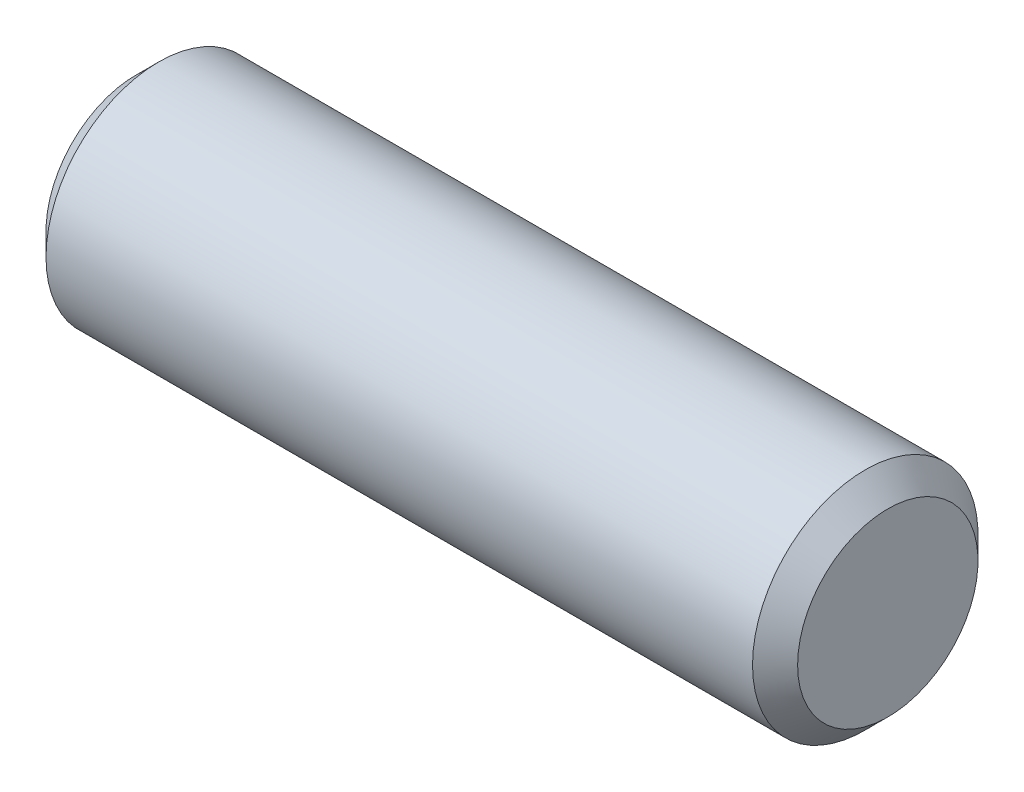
ISO-10303-21;
HEADER;
FILE_DESCRIPTION(('STEP AP214'),'2;1');
FILE_NAME('part.step','',(''),(''),'','','');
FILE_SCHEMA(('AUTOMOTIVE_DESIGN { 1 0 10303 214 1 1 1 1 }'));
ENDSEC;
DATA;
#1=APPLICATION_CONTEXT('core data for automotive mechanical design processes');
#2=APPLICATION_PROTOCOL_DEFINITION('international standard','automotive_design',2000,#1);
#3=PRODUCT_CONTEXT('',#1,'mechanical');
#4=PRODUCT('Part','Part','',(#3));
#5=PRODUCT_RELATED_PRODUCT_CATEGORY('part','',(#4));
#6=PRODUCT_DEFINITION_FORMATION('','',#4);
#7=PRODUCT_DEFINITION_CONTEXT('part definition',#1,'design');
#8=PRODUCT_DEFINITION('design','',#6,#7);
#9=PRODUCT_DEFINITION_SHAPE('','',#8);
#10=(LENGTH_UNIT() NAMED_UNIT(*) SI_UNIT(.MILLI.,.METRE.));
#11=(NAMED_UNIT(*) PLANE_ANGLE_UNIT() SI_UNIT($,.RADIAN.));
#12=(NAMED_UNIT(*) SI_UNIT($,.STERADIAN.) SOLID_ANGLE_UNIT());
#13=UNCERTAINTY_MEASURE_WITH_UNIT(LENGTH_MEASURE(1.E-05),#10,'distance_accuracy_value','');
#14=(GEOMETRIC_REPRESENTATION_CONTEXT(3) GLOBAL_UNCERTAINTY_ASSIGNED_CONTEXT((#13)) GLOBAL_UNIT_ASSIGNED_CONTEXT((#10,
#11,#12)) REPRESENTATION_CONTEXT('',''));
#15=CARTESIAN_POINT('',(0.,0.,0.));
#16=DIRECTION('',(0.,0.,1.));
#17=DIRECTION('',(1.,0.,0.));
#18=AXIS2_PLACEMENT_3D('',#15,#16,#17);
#19=CARTESIAN_POINT('',(0.,0.,0.));
#20=DIRECTION('',(1.,0.,0.));
#21=DIRECTION('',(0.,0.,-1.));
#22=AXIS2_PLACEMENT_3D('',#19,#20,#21);
#23=PLANE('',#22);
#24=CARTESIAN_POINT('',(0.,0.,0.));
#25=DIRECTION('',(1.,0.,0.));
#26=DIRECTION('',(0.,0.,-1.));
#27=AXIS2_PLACEMENT_3D('',#24,#25,#26);
#28=CIRCLE('',#27,1.2);
#29=CARTESIAN_POINT('',(0.,0.,-1.2));
#30=VERTEX_POINT('',#29);
#31=EDGE_CURVE('E127',#30,#30,#28,.F.);
#32=ORIENTED_EDGE('',*,*,#31,.T.);
#33=EDGE_LOOP('',(#32));
#34=FACE_BOUND('',#33,.T.);
#35=DIRECTION('',(0.,0.866025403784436,-0.500000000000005));
#36=VECTOR('',#35,1.);
#37=CARTESIAN_POINT('',(0.,0.,0.866025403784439));
#38=LINE('',#37,#36);
#39=CARTESIAN_POINT('',(0.,0.,0.866025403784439));
#40=VERTEX_POINT('',#39);
#41=CARTESIAN_POINT('',(0.,0.750000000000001,0.433012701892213));
#42=VERTEX_POINT('',#41);
#43=EDGE_CURVE('E95',#40,#42,#38,.T.);
#44=ORIENTED_EDGE('',*,*,#43,.F.);
#45=DIRECTION('',(0.,0.866025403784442,0.499999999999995));
#46=VECTOR('',#45,1.);
#47=CARTESIAN_POINT('',(0.,-0.749999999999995,0.433012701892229));
#48=LINE('',#47,#46);
#49=CARTESIAN_POINT('',(0.,-0.749999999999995,0.433012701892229));
#50=VERTEX_POINT('',#49);
#51=EDGE_CURVE('E41',#50,#40,#48,.T.);
#52=ORIENTED_EDGE('',*,*,#51,.F.);
#53=DIRECTION('',(0.,0.,1.));
#54=VECTOR('',#53,1.);
#55=CARTESIAN_POINT('',(0.,-0.75,-0.433012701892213));
#56=LINE('',#55,#54);
#57=CARTESIAN_POINT('',(0.,-0.75,-0.433012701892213));
#58=VERTEX_POINT('',#57);
#59=EDGE_CURVE('E109',#58,#50,#56,.T.);
#60=ORIENTED_EDGE('',*,*,#59,.F.);
#61=DIRECTION('',(0.,-0.866025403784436,0.500000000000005));
#62=VECTOR('',#61,1.);
#63=CARTESIAN_POINT('',(0.,0.,-0.866025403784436));
#64=LINE('',#63,#62);
#65=CARTESIAN_POINT('',(0.,0.,-0.866025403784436));
#66=VERTEX_POINT('',#65);
#67=EDGE_CURVE('E103',#66,#58,#64,.T.);
#68=ORIENTED_EDGE('',*,*,#67,.F.);
#69=DIRECTION('',(0.,-0.866025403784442,-0.499999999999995));
#70=VECTOR('',#69,1.);
#71=CARTESIAN_POINT('',(0.,0.749999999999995,-0.433012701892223));
#72=LINE('',#71,#70);
#73=CARTESIAN_POINT('',(0.,0.749999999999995,-0.433012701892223));
#74=VERTEX_POINT('',#73);
#75=EDGE_CURVE('E101',#74,#66,#72,.T.);
#76=ORIENTED_EDGE('',*,*,#75,.F.);
#77=DIRECTION('',(0.,0.,-1.));
#78=VECTOR('',#77,1.);
#79=CARTESIAN_POINT('',(0.,0.750000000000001,0.433012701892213));
#80=LINE('',#79,#78);
#81=EDGE_CURVE('E84',#42,#74,#80,.T.);
#82=ORIENTED_EDGE('',*,*,#81,.F.);
#83=EDGE_LOOP('',(#44,#52,#60,#68,#76,#82));
#84=FACE_BOUND('',#83,.T.);
#85=ADVANCED_FACE('F27',(#34,#84),#23,.F.);
#86=CARTESIAN_POINT('',(0.,0.,0.));
#87=DIRECTION('',(-1.,0.,0.));
#88=DIRECTION('',(0.,0.,1.));
#89=AXIS2_PLACEMENT_3D('',#86,#87,#88);
#90=CYLINDRICAL_SURFACE('',#89,1.5);
#91=CARTESIAN_POINT('',(0.300000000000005,0.,0.));
#92=DIRECTION('',(1.,0.,0.));
#93=DIRECTION('',(0.,0.,-1.));
#94=AXIS2_PLACEMENT_3D('',#91,#92,#93);
#95=CIRCLE('',#94,1.5);
#96=CARTESIAN_POINT('',(0.300000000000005,0.,-1.5));
#97=VERTEX_POINT('',#96);
#98=EDGE_CURVE('E34',#97,#97,#95,.T.);
#99=ORIENTED_EDGE('',*,*,#98,.T.);
#100=EDGE_LOOP('',(#99));
#101=FACE_BOUND('',#100,.T.);
#102=CARTESIAN_POINT('',(9.69999999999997,0.,0.));
#103=DIRECTION('',(-1.,0.,0.));
#104=DIRECTION('',(0.,0.,1.));
#105=AXIS2_PLACEMENT_3D('',#102,#103,#104);
#106=CIRCLE('',#105,1.5);
#107=CARTESIAN_POINT('',(9.69999999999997,0.,1.5));
#108=VERTEX_POINT('',#107);
#109=EDGE_CURVE('E136',#108,#108,#106,.T.);
#110=ORIENTED_EDGE('',*,*,#109,.T.);
#111=EDGE_LOOP('',(#110));
#112=FACE_BOUND('',#111,.T.);
#113=ADVANCED_FACE('F141',(#101,#112),#90,.T.);
#114=CARTESIAN_POINT('',(9.99999999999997,1.5,0.));
#115=DIRECTION('',(-1.,0.,0.));
#116=DIRECTION('',(0.,0.,1.));
#117=AXIS2_PLACEMENT_3D('',#114,#115,#116);
#118=PLANE('',#117);
#119=CARTESIAN_POINT('',(9.99999999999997,0.,0.));
#120=DIRECTION('',(-1.,0.,0.));
#121=DIRECTION('',(0.,0.,1.));
#122=AXIS2_PLACEMENT_3D('',#119,#120,#121);
#123=CIRCLE('',#122,1.2);
#124=CARTESIAN_POINT('',(9.99999999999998,0.,1.2));
#125=VERTEX_POINT('',#124);
#126=EDGE_CURVE('E11',#125,#125,#123,.F.);
#127=ORIENTED_EDGE('',*,*,#126,.T.);
#128=EDGE_LOOP('',(#127));
#129=FACE_BOUND('',#128,.T.);
#130=ADVANCED_FACE('F156',(#129),#118,.F.);
#131=CARTESIAN_POINT('',(1.5,-0.749999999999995,0.433012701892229));
#132=DIRECTION('',(0.,-0.499999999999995,0.866025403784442));
#133=DIRECTION('',(0.,-0.866025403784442,-0.499999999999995));
#134=AXIS2_PLACEMENT_3D('',#131,#132,#133);
#135=PLANE('',#134);
#136=ORIENTED_EDGE('',*,*,#51,.T.);
#137=DIRECTION('',(-1.,0.,0.));
#138=VECTOR('',#137,1.);
#139=CARTESIAN_POINT('',(1.5,0.,0.866025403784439));
#140=LINE('',#139,#138);
#141=CARTESIAN_POINT('',(1.5,0.,0.866025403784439));
#142=VERTEX_POINT('',#141);
#143=EDGE_CURVE('E92',#142,#40,#140,.T.);
#144=ORIENTED_EDGE('',*,*,#143,.F.);
#145=DIRECTION('',(0.,0.866025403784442,0.499999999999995));
#146=VECTOR('',#145,1.);
#147=CARTESIAN_POINT('',(1.5,-0.749999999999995,0.433012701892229));
#148=LINE('',#147,#146);
#149=CARTESIAN_POINT('',(1.5,-0.749999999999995,0.433012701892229));
#150=VERTEX_POINT('',#149);
#151=EDGE_CURVE('E111',#150,#142,#148,.T.);
#152=ORIENTED_EDGE('',*,*,#151,.F.);
#153=DIRECTION('',(-1.,0.,0.));
#154=VECTOR('',#153,1.);
#155=CARTESIAN_POINT('',(1.5,-0.749999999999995,0.433012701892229));
#156=LINE('',#155,#154);
#157=EDGE_CURVE('E48',#150,#50,#156,.T.);
#158=ORIENTED_EDGE('',*,*,#157,.T.);
#159=EDGE_LOOP('',(#136,#144,#152,#158));
#160=FACE_BOUND('',#159,.T.);
#161=ADVANCED_FACE('F160',(#160),#135,.F.);
#162=CARTESIAN_POINT('',(1.5,-0.75,-0.433012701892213));
#163=DIRECTION('',(0.,-1.,0.));
#164=DIRECTION('',(0.,0.,-1.));
#165=AXIS2_PLACEMENT_3D('',#162,#163,#164);
#166=PLANE('',#165);
#167=ORIENTED_EDGE('',*,*,#59,.T.);
#168=ORIENTED_EDGE('',*,*,#157,.F.);
#169=DIRECTION('',(0.,0.,1.));
#170=VECTOR('',#169,1.);
#171=CARTESIAN_POINT('',(1.5,-0.75,-0.433012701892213));
#172=LINE('',#171,#170);
#173=CARTESIAN_POINT('',(1.5,-0.75,-0.433012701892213));
#174=VERTEX_POINT('',#173);
#175=EDGE_CURVE('E123',#174,#150,#172,.T.);
#176=ORIENTED_EDGE('',*,*,#175,.F.);
#177=DIRECTION('',(-1.,0.,0.));
#178=VECTOR('',#177,1.);
#179=CARTESIAN_POINT('',(1.5,-0.75,-0.433012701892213));
#180=LINE('',#179,#178);
#181=EDGE_CURVE('E128',#174,#58,#180,.T.);
#182=ORIENTED_EDGE('',*,*,#181,.T.);
#183=EDGE_LOOP('',(#167,#168,#176,#182));
#184=FACE_BOUND('',#183,.T.);
#185=ADVANCED_FACE('F166',(#184),#166,.F.);
#186=CARTESIAN_POINT('',(1.5,0.,-0.866025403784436));
#187=DIRECTION('',(0.,-0.500000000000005,-0.866025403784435));
#188=DIRECTION('',(0.,0.866025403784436,-0.500000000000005));
#189=AXIS2_PLACEMENT_3D('',#186,#187,#188);
#190=PLANE('',#189);
#191=ORIENTED_EDGE('',*,*,#67,.T.);
#192=ORIENTED_EDGE('',*,*,#181,.F.);
#193=DIRECTION('',(0.,-0.866025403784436,0.500000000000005));
#194=VECTOR('',#193,1.);
#195=CARTESIAN_POINT('',(1.5,0.,-0.866025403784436));
#196=LINE('',#195,#194);
#197=CARTESIAN_POINT('',(1.5,0.,-0.866025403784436));
#198=VERTEX_POINT('',#197);
#199=EDGE_CURVE('E120',#198,#174,#196,.T.);
#200=ORIENTED_EDGE('',*,*,#199,.F.);
#201=DIRECTION('',(-1.,0.,0.));
#202=VECTOR('',#201,1.);
#203=CARTESIAN_POINT('',(1.5,0.,-0.866025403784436));
#204=LINE('',#203,#202);
#205=EDGE_CURVE('E130',#198,#66,#204,.T.);
#206=ORIENTED_EDGE('',*,*,#205,.T.);
#207=EDGE_LOOP('',(#191,#192,#200,#206));
#208=FACE_BOUND('',#207,.T.);
#209=ADVANCED_FACE('F174',(#208),#190,.F.);
#210=CARTESIAN_POINT('',(1.5,0.749999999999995,-0.433012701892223));
#211=DIRECTION('',(0.,0.499999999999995,-0.866025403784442));
#212=DIRECTION('',(0.,0.866025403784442,0.499999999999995));
#213=AXIS2_PLACEMENT_3D('',#210,#211,#212);
#214=PLANE('',#213);
#215=ORIENTED_EDGE('',*,*,#75,.T.);
#216=ORIENTED_EDGE('',*,*,#205,.F.);
#217=DIRECTION('',(0.,-0.866025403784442,-0.499999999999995));
#218=VECTOR('',#217,1.);
#219=CARTESIAN_POINT('',(1.5,0.749999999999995,-0.433012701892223));
#220=LINE('',#219,#218);
#221=CARTESIAN_POINT('',(1.5,0.749999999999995,-0.433012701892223));
#222=VERTEX_POINT('',#221);
#223=EDGE_CURVE('E117',#222,#198,#220,.T.);
#224=ORIENTED_EDGE('',*,*,#223,.F.);
#225=DIRECTION('',(-1.,0.,0.));
#226=VECTOR('',#225,1.);
#227=CARTESIAN_POINT('',(1.5,0.749999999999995,-0.433012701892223));
#228=LINE('',#227,#226);
#229=EDGE_CURVE('E91',#222,#74,#228,.T.);
#230=ORIENTED_EDGE('',*,*,#229,.T.);
#231=EDGE_LOOP('',(#215,#216,#224,#230));
#232=FACE_BOUND('',#231,.T.);
#233=ADVANCED_FACE('F171',(#232),#214,.F.);
#234=CARTESIAN_POINT('',(1.5,0.750000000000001,0.433012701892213));
#235=DIRECTION('',(0.,1.,0.));
#236=DIRECTION('',(0.,0.,1.));
#237=AXIS2_PLACEMENT_3D('',#234,#235,#236);
#238=PLANE('',#237);
#239=ORIENTED_EDGE('',*,*,#81,.T.);
#240=ORIENTED_EDGE('',*,*,#229,.F.);
#241=DIRECTION('',(0.,0.,-1.));
#242=VECTOR('',#241,1.);
#243=CARTESIAN_POINT('',(1.5,0.750000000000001,0.433012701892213));
#244=LINE('',#243,#242);
#245=CARTESIAN_POINT('',(1.5,0.750000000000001,0.433012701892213));
#246=VERTEX_POINT('',#245);
#247=EDGE_CURVE('E87',#246,#222,#244,.T.);
#248=ORIENTED_EDGE('',*,*,#247,.F.);
#249=DIRECTION('',(-1.,0.,0.));
#250=VECTOR('',#249,1.);
#251=CARTESIAN_POINT('',(1.5,0.750000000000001,0.433012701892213));
#252=LINE('',#251,#250);
#253=EDGE_CURVE('E80',#246,#42,#252,.T.);
#254=ORIENTED_EDGE('',*,*,#253,.T.);
#255=EDGE_LOOP('',(#239,#240,#248,#254));
#256=FACE_BOUND('',#255,.T.);
#257=ADVANCED_FACE('F82',(#256),#238,.F.);
#258=CARTESIAN_POINT('',(1.5,0.,0.866025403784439));
#259=DIRECTION('',(0.,0.500000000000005,0.866025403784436));
#260=DIRECTION('',(0.,-0.866025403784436,0.500000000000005));
#261=AXIS2_PLACEMENT_3D('',#258,#259,#260);
#262=PLANE('',#261);
#263=ORIENTED_EDGE('',*,*,#43,.T.);
#264=ORIENTED_EDGE('',*,*,#253,.F.);
#265=DIRECTION('',(0.,0.866025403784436,-0.500000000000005));
#266=VECTOR('',#265,1.);
#267=CARTESIAN_POINT('',(1.5,0.,0.866025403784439));
#268=LINE('',#267,#266);
#269=EDGE_CURVE('E114',#142,#246,#268,.T.);
#270=ORIENTED_EDGE('',*,*,#269,.F.);
#271=ORIENTED_EDGE('',*,*,#143,.T.);
#272=EDGE_LOOP('',(#263,#264,#270,#271));
#273=FACE_BOUND('',#272,.T.);
#274=ADVANCED_FACE('F96',(#273),#262,.F.);
#275=CARTESIAN_POINT('',(1.5,-0.749999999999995,0.433012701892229));
#276=DIRECTION('',(1.,0.,0.));
#277=DIRECTION('',(0.,0.,-1.));
#278=AXIS2_PLACEMENT_3D('',#275,#276,#277);
#279=PLANE('',#278);
#280=ORIENTED_EDGE('',*,*,#151,.T.);
#281=ORIENTED_EDGE('',*,*,#269,.T.);
#282=ORIENTED_EDGE('',*,*,#247,.T.);
#283=ORIENTED_EDGE('',*,*,#223,.T.);
#284=ORIENTED_EDGE('',*,*,#199,.T.);
#285=ORIENTED_EDGE('',*,*,#175,.T.);
#286=EDGE_LOOP('',(#280,#281,#282,#283,#284,#285));
#287=FACE_BOUND('',#286,.T.);
#288=ADVANCED_FACE('F148',(#287),#279,.F.);
#289=CARTESIAN_POINT('',(0.,0.,0.));
#290=DIRECTION('',(1.,0.,0.));
#291=DIRECTION('',(0.,0.,-1.));
#292=AXIS2_PLACEMENT_3D('',#289,#290,#291);
#293=CONICAL_SURFACE('',#292,1.2,0.785398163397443);
#294=ORIENTED_EDGE('',*,*,#98,.F.);
#295=EDGE_LOOP('',(#294));
#296=FACE_BOUND('',#295,.T.);
#297=ORIENTED_EDGE('',*,*,#31,.F.);
#298=EDGE_LOOP('',(#297));
#299=FACE_BOUND('',#298,.T.);
#300=ADVANCED_FACE('F144',(#296,#299),#293,.T.);
#301=CARTESIAN_POINT('',(9.69999999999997,0.,0.));
#302=DIRECTION('',(-1.,0.,0.));
#303=DIRECTION('',(0.,0.,1.));
#304=AXIS2_PLACEMENT_3D('',#301,#302,#303);
#305=CONICAL_SURFACE('',#304,1.5,0.785398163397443);
#306=CARTESIAN_POINT('',(9.99999999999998,0.,1.2));
#307=CARTESIAN_POINT('',(9.99687499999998,0.,1.203125));
#308=CARTESIAN_POINT('',(9.99374999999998,0.,1.20625));
#309=CARTESIAN_POINT('',(9.98749999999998,0.,1.2125));
#310=CARTESIAN_POINT('',(9.98437499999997,0.,1.215625));
#311=CARTESIAN_POINT('',(9.97812499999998,0.,1.221875));
#312=CARTESIAN_POINT('',(9.97499999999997,0.,1.225));
#313=CARTESIAN_POINT('',(9.96874999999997,0.,1.23125));
#314=CARTESIAN_POINT('',(9.96562499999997,0.,1.234375));
#315=CARTESIAN_POINT('',(9.95937499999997,0.,1.240625));
#316=CARTESIAN_POINT('',(9.95624999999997,0.,1.24375));
#317=CARTESIAN_POINT('',(9.94999999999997,0.,1.25));
#318=CARTESIAN_POINT('',(9.94687499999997,0.,1.253125));
#319=CARTESIAN_POINT('',(9.94062499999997,0.,1.259375));
#320=CARTESIAN_POINT('',(9.93749999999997,0.,1.2625));
#321=CARTESIAN_POINT('',(9.93124999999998,0.,1.26875));
#322=CARTESIAN_POINT('',(9.92812499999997,0.,1.271875));
#323=CARTESIAN_POINT('',(9.92187499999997,0.,1.278125));
#324=CARTESIAN_POINT('',(9.91874999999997,0.,1.28125));
#325=CARTESIAN_POINT('',(9.91249999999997,0.,1.2875));
#326=CARTESIAN_POINT('',(9.90937499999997,0.,1.290625));
#327=CARTESIAN_POINT('',(9.90312499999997,0.,1.296875));
#328=CARTESIAN_POINT('',(9.89999999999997,0.,1.3));
#329=CARTESIAN_POINT('',(9.89374999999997,0.,1.30625));
#330=CARTESIAN_POINT('',(9.89062499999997,0.,1.309375));
#331=CARTESIAN_POINT('',(9.88437499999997,0.,1.315625));
#332=CARTESIAN_POINT('',(9.88124999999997,0.,1.31875));
#333=CARTESIAN_POINT('',(9.87499999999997,0.,1.325));
#334=CARTESIAN_POINT('',(9.87187499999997,0.,1.328125));
#335=CARTESIAN_POINT('',(9.86562499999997,0.,1.334375));
#336=CARTESIAN_POINT('',(9.86249999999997,0.,1.3375));
#337=CARTESIAN_POINT('',(9.85624999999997,0.,1.34375));
#338=CARTESIAN_POINT('',(9.85312499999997,0.,1.346875));
#339=CARTESIAN_POINT('',(9.84687499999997,0.,1.353125));
#340=CARTESIAN_POINT('',(9.84374999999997,0.,1.35625));
#341=CARTESIAN_POINT('',(9.83749999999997,0.,1.3625));
#342=CARTESIAN_POINT('',(9.83437499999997,0.,1.365625));
#343=CARTESIAN_POINT('',(9.82812499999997,0.,1.371875));
#344=CARTESIAN_POINT('',(9.82499999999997,0.,1.375));
#345=CARTESIAN_POINT('',(9.81874999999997,0.,1.38125));
#346=CARTESIAN_POINT('',(9.81562499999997,0.,1.384375));
#347=CARTESIAN_POINT('',(9.80937499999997,0.,1.390625));
#348=CARTESIAN_POINT('',(9.80624999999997,0.,1.39375));
#349=CARTESIAN_POINT('',(9.79999999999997,0.,1.4));
#350=CARTESIAN_POINT('',(9.79687499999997,0.,1.403125));
#351=CARTESIAN_POINT('',(9.79062499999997,0.,1.409375));
#352=CARTESIAN_POINT('',(9.78749999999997,0.,1.4125));
#353=CARTESIAN_POINT('',(9.78124999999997,0.,1.41875));
#354=CARTESIAN_POINT('',(9.77812499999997,0.,1.421875));
#355=CARTESIAN_POINT('',(9.77187499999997,0.,1.428125));
#356=CARTESIAN_POINT('',(9.76874999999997,0.,1.43125));
#357=CARTESIAN_POINT('',(9.76249999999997,0.,1.4375));
#358=CARTESIAN_POINT('',(9.75937499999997,0.,1.440625));
#359=CARTESIAN_POINT('',(9.75312499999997,0.,1.446875));
#360=CARTESIAN_POINT('',(9.74999999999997,0.,1.45));
#361=CARTESIAN_POINT('',(9.74374999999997,0.,1.45625));
#362=CARTESIAN_POINT('',(9.74062499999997,0.,1.459375));
#363=CARTESIAN_POINT('',(9.73437499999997,0.,1.465625));
#364=CARTESIAN_POINT('',(9.73124999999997,0.,1.46875));
#365=CARTESIAN_POINT('',(9.72499999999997,0.,1.475));
#366=CARTESIAN_POINT('',(9.72187499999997,0.,1.478125));
#367=CARTESIAN_POINT('',(9.71562499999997,0.,1.484375));
#368=CARTESIAN_POINT('',(9.71249999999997,0.,1.4875));
#369=CARTESIAN_POINT('',(9.70624999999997,0.,1.49375));
#370=CARTESIAN_POINT('',(9.70312499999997,0.,1.496875));
#371=CARTESIAN_POINT('',(9.69999999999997,0.,1.5));
#372=B_SPLINE_CURVE_WITH_KNOTS('',3,(#306,#307,#308,#309,#310,#311,#312,#313,#314,#315,#316,
#317,#318,#319,#320,#321,#322,#323,#324,#325,#326,#327,#328,#329,#330,#331,#332,#333,#334,#335,
#336,#337,#338,#339,#340,#341,#342,#343,#344,#345,#346,#347,#348,#349,#350,#351,#352,#353,#354,
#355,#356,#357,#358,#359,#360,#361,#362,#363,#364,#365,#366,#367,#368,#369,#370,#371),
.UNSPECIFIED.,.F.,.F.,(4,2,2,2,2,2,2,2,2,2,2,2,2,2,2,2,2,2,2,2,2,2,2,2,2,2,2,2,2,2,2,2,4),(0.,
0.0132582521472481,0.0265165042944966,0.0397747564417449,0.053033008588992,0.0662912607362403,
0.0795495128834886,0.0928077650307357,0.106066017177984,0.119324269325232,0.132582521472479,
0.145840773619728,0.159099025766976,0.172357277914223,0.185615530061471,0.19887378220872,
0.212132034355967,0.225390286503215,0.238648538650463,0.251906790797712,0.265165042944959,
0.278423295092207,0.291681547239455,0.304939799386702,0.318198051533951,0.331456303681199,
0.344714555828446,0.357972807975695,0.371231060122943,0.38448931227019,0.397747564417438,
0.411005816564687,0.424264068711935),.UNSPECIFIED.);
#373=EDGE_CURVE('BSEAM147',#125,#108,#372,.T.);
#374=ORIENTED_EDGE('',*,*,#126,.F.);
#375=ORIENTED_EDGE('',*,*,#109,.F.);
#376=ORIENTED_EDGE('',*,*,#373,.T.);
#377=ORIENTED_EDGE('',*,*,#373,.F.);
#378=EDGE_LOOP('',(#374,#376,#375,#377));
#379=FACE_BOUND('',#378,.T.);
#380=ADVANCED_FACE('F147',(#379),#305,.T.);
#381=CLOSED_SHELL('',(#85,#113,#130,#161,#185,#209,#233,#257,#274,#288,#300,#380));
#382=MANIFOLD_SOLID_BREP('B2',#381);
#383=ADVANCED_BREP_SHAPE_REPRESENTATION('',(#18,#382),#14);
#384=SHAPE_DEFINITION_REPRESENTATION(#9,#383);
ENDSEC;
END-ISO-10303-21;
